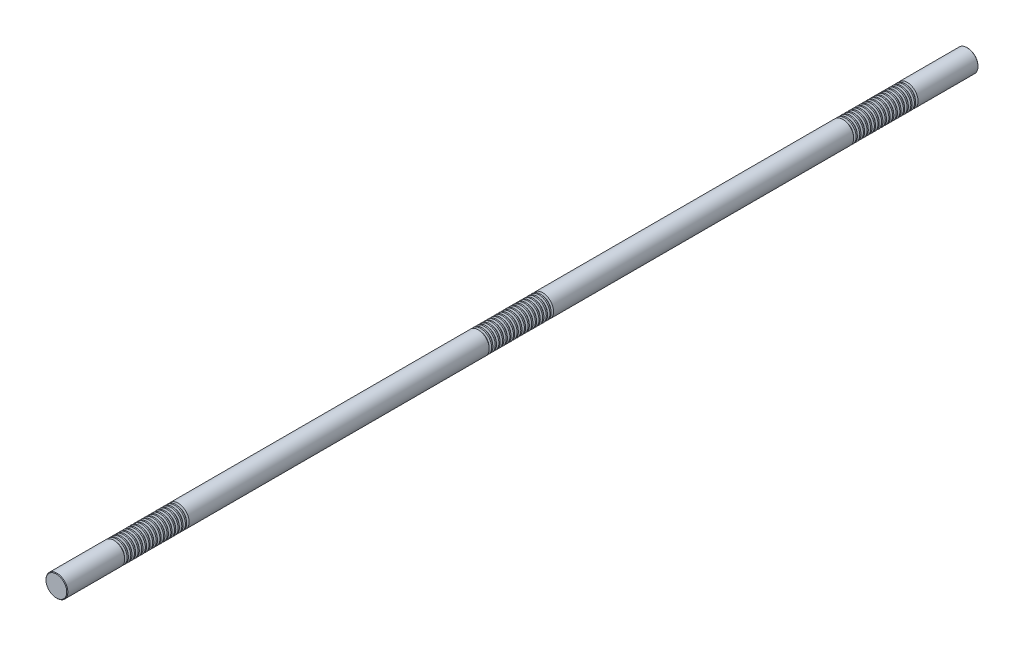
from build123d import *

# Parameters (mm, degrees)
SKETCH1_R           = 18
BOSS_EXTRUDE1_DEPTH = 750
CHAMFER1_SIZE       = 0.9
LPATTERN1_COUNT     = 18
LPATTERN1_PITCH     = 6
LPATTERN2_COUNT     = 3
LPATTERN2_PITCH     = 600


with BuildPart() as part:
    # Sketch1 → Boss-Extrude1 (new, symmetric)
    with BuildSketch(Plane.XY):
        Circle(SKETCH1_R)
    extrude(amount=BOSS_EXTRUDE1_DEPTH, both=True)

    # Chamfer1
    chamfer1_edges = [part.edges().sort_by_distance(p)[0] for p in [
        (-18, 0, -750),
        (-18, 0, 750),
    ]]
    chamfer(chamfer1_edges, length=CHAMFER1_SIZE)

    # Sketch2 → Cut-Revolve1 (revolve, cut)
    with BuildSketch(Plane(origin=(0, 0, 0), x_dir=(0, 0, -1), z_dir=(1, 0, 0)), mode=Mode.PRIVATE) as cut_revolve1_sk:
        Polygon((650.468911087, 18), (646.531088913, 18), (647.468911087, 14.5), (649.531088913, 14.5), align=None)
    cut_revolve1 = revolve(cut_revolve1_sk.sketch.rotate(Axis((0, 0, 750), (0, 0, -1)), 90), axis=Axis((0, 0, 750), (0, 0, -1)), mode=Mode.SUBTRACT)

    # LPattern1: Cut-Revolve1 ×18
    with Locations(*[(0, 0, i * LPATTERN1_PITCH) for i in range(1, LPATTERN1_COUNT)]):
        add(cut_revolve1, mode=Mode.SUBTRACT)

    # LPattern2: Cut-Revolve1 ×3
    with Locations(*[(0, 0, i * LPATTERN2_PITCH) for i in range(1, LPATTERN2_COUNT)]):
        add(cut_revolve1, mode=Mode.SUBTRACT)

    # LPattern2 copy 1 sketch → LPattern2 copy 1 (revolve, cut)
    with BuildSketch(Plane(origin=(0, 0, 606), x_dir=(0, 0, -1), z_dir=(1, 0, 0))):
        Polygon((650.468911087, 18), (646.531088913, 18), (647.468911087, 14.5), (649.531088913, 14.5), align=None)
    revolve(axis=Axis((0, 0, 1356), (0, 0, -1)), mode=Mode.SUBTRACT)

    # LPattern2 copy 2 sketch → LPattern2 copy 2 (revolve, cut)
    with BuildSketch(Plane(origin=(0, 0, 1206), x_dir=(0, 0, -1), z_dir=(1, 0, 0))):
        Polygon((650.468911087, 18), (646.531088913, 18), (647.468911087, 14.5), (649.531088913, 14.5), align=None)
    revolve(axis=Axis((0, 0, 1956), (0, 0, -1)), mode=Mode.SUBTRACT)

    # LPattern2 copy 3 sketch → LPattern2 copy 3 (revolve, cut)
    with BuildSketch(Plane(origin=(0, 0, 612), x_dir=(0, 0, -1), z_dir=(1, 0, 0))):
        Polygon((650.468911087, 18), (646.531088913, 18), (647.468911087, 14.5), (649.531088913, 14.5), align=None)
    revolve(axis=Axis((0, 0, 1362), (0, 0, -1)), mode=Mode.SUBTRACT)

    # LPattern2 copy 4 sketch → LPattern2 copy 4 (revolve, cut)
    with BuildSketch(Plane(origin=(0, 0, 1212), x_dir=(0, 0, -1), z_dir=(1, 0, 0))):
        Polygon((650.468911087, 18), (646.531088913, 18), (647.468911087, 14.5), (649.531088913, 14.5), align=None)
    revolve(axis=Axis((0, 0, 1962), (0, 0, -1)), mode=Mode.SUBTRACT)

    # LPattern2 copy 5 sketch → LPattern2 copy 5 (revolve, cut)
    with BuildSketch(Plane(origin=(0, 0, 618), x_dir=(0, 0, -1), z_dir=(1, 0, 0))):
        Polygon((650.468911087, 18), (646.531088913, 18), (647.468911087, 14.5), (649.531088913, 14.5), align=None)
    revolve(axis=Axis((0, 0, 1368), (0, 0, -1)), mode=Mode.SUBTRACT)

    # LPattern2 copy 6 sketch → LPattern2 copy 6 (revolve, cut)
    with BuildSketch(Plane(origin=(0, 0, 1218), x_dir=(0, 0, -1), z_dir=(1, 0, 0))):
        Polygon((650.468911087, 18), (646.531088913, 18), (647.468911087, 14.5), (649.531088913, 14.5), align=None)
    revolve(axis=Axis((0, 0, 1968), (0, 0, -1)), mode=Mode.SUBTRACT)

    # LPattern2 copy 7 sketch → LPattern2 copy 7 (revolve, cut)
    with BuildSketch(Plane(origin=(0, 0, 624), x_dir=(0, 0, -1), z_dir=(1, 0, 0))):
        Polygon((650.468911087, 18), (646.531088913, 18), (647.468911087, 14.5), (649.531088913, 14.5), align=None)
    revolve(axis=Axis((0, 0, 1374), (0, 0, -1)), mode=Mode.SUBTRACT)

    # LPattern2 copy 8 sketch → LPattern2 copy 8 (revolve, cut)
    with BuildSketch(Plane(origin=(0, 0, 1224), x_dir=(0, 0, -1), z_dir=(1, 0, 0))):
        Polygon((650.468911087, 18), (646.531088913, 18), (647.468911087, 14.5), (649.531088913, 14.5), align=None)
    revolve(axis=Axis((0, 0, 1974), (0, 0, -1)), mode=Mode.SUBTRACT)

    # LPattern2 copy 9 sketch → LPattern2 copy 9 (revolve, cut)
    with BuildSketch(Plane(origin=(0, 0, 630), x_dir=(0, 0, -1), z_dir=(1, 0, 0))):
        Polygon((650.468911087, 18), (646.531088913, 18), (647.468911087, 14.5), (649.531088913, 14.5), align=None)
    revolve(axis=Axis((0, 0, 1380), (0, 0, -1)), mode=Mode.SUBTRACT)

    # LPattern2 copy 10 sketch → LPattern2 copy 10 (revolve, cut)
    with BuildSketch(Plane(origin=(0, 0, 1230), x_dir=(0, 0, -1), z_dir=(1, 0, 0))):
        Polygon((650.468911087, 18), (646.531088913, 18), (647.468911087, 14.5), (649.531088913, 14.5), align=None)
    revolve(axis=Axis((0, 0, 1980), (0, 0, -1)), mode=Mode.SUBTRACT)

    # LPattern2 copy 11 sketch → LPattern2 copy 11 (revolve, cut)
    with BuildSketch(Plane(origin=(0, 0, 636), x_dir=(0, 0, -1), z_dir=(1, 0, 0))):
        Polygon((650.468911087, 18), (646.531088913, 18), (647.468911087, 14.5), (649.531088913, 14.5), align=None)
    revolve(axis=Axis((0, 0, 1386), (0, 0, -1)), mode=Mode.SUBTRACT)

    # LPattern2 copy 12 sketch → LPattern2 copy 12 (revolve, cut)
    with BuildSketch(Plane(origin=(0, 0, 1236), x_dir=(0, 0, -1), z_dir=(1, 0, 0))):
        Polygon((650.468911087, 18), (646.531088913, 18), (647.468911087, 14.5), (649.531088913, 14.5), align=None)
    revolve(axis=Axis((0, 0, 1986), (0, 0, -1)), mode=Mode.SUBTRACT)

    # LPattern2 copy 13 sketch → LPattern2 copy 13 (revolve, cut)
    with BuildSketch(Plane(origin=(0, 0, 642), x_dir=(0, 0, -1), z_dir=(1, 0, 0))):
        Polygon((650.468911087, 18), (646.531088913, 18), (647.468911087, 14.5), (649.531088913, 14.5), align=None)
    revolve(axis=Axis((0, 0, 1392), (0, 0, -1)), mode=Mode.SUBTRACT)

    # LPattern2 copy 14 sketch → LPattern2 copy 14 (revolve, cut)
    with BuildSketch(Plane(origin=(0, 0, 1242), x_dir=(0, 0, -1), z_dir=(1, 0, 0))):
        Polygon((650.468911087, 18), (646.531088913, 18), (647.468911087, 14.5), (649.531088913, 14.5), align=None)
    revolve(axis=Axis((0, 0, 1992), (0, 0, -1)), mode=Mode.SUBTRACT)

    # LPattern2 copy 15 sketch → LPattern2 copy 15 (revolve, cut)
    with BuildSketch(Plane(origin=(0, 0, 648), x_dir=(0, 0, -1), z_dir=(1, 0, 0))):
        Polygon((650.468911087, 18), (646.531088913, 18), (647.468911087, 14.5), (649.531088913, 14.5), align=None)
    revolve(axis=Axis((0, 0, 1398), (0, 0, -1)), mode=Mode.SUBTRACT)

    # LPattern2 copy 16 sketch → LPattern2 copy 16 (revolve, cut)
    with BuildSketch(Plane(origin=(0, 0, 1248), x_dir=(0, 0, -1), z_dir=(1, 0, 0))):
        Polygon((650.468911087, 18), (646.531088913, 18), (647.468911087, 14.5), (649.531088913, 14.5), align=None)
    revolve(axis=Axis((0, 0, 1998), (0, 0, -1)), mode=Mode.SUBTRACT)

    # LPattern2 copy 17 sketch → LPattern2 copy 17 (revolve, cut)
    with BuildSketch(Plane(origin=(0, 0, 654), x_dir=(0, 0, -1), z_dir=(1, 0, 0))):
        Polygon((650.468911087, 18), (646.531088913, 18), (647.468911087, 14.5), (649.531088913, 14.5), align=None)
    revolve(axis=Axis((0, 0, 1404), (0, 0, -1)), mode=Mode.SUBTRACT)

    # LPattern2 copy 18 sketch → LPattern2 copy 18 (revolve, cut)
    with BuildSketch(Plane(origin=(0, 0, 1254), x_dir=(0, 0, -1), z_dir=(1, 0, 0))):
        Polygon((650.468911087, 18), (646.531088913, 18), (647.468911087, 14.5), (649.531088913, 14.5), align=None)
    revolve(axis=Axis((0, 0, 2004), (0, 0, -1)), mode=Mode.SUBTRACT)

    # LPattern2 copy 19 sketch → LPattern2 copy 19 (revolve, cut)
    with BuildSketch(Plane(origin=(0, 0, 660), x_dir=(0, 0, -1), z_dir=(1, 0, 0))):
        Polygon((650.468911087, 18), (646.531088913, 18), (647.468911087, 14.5), (649.531088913, 14.5), align=None)
    revolve(axis=Axis((0, 0, 1410), (0, 0, -1)), mode=Mode.SUBTRACT)

    # LPattern2 copy 20 sketch → LPattern2 copy 20 (revolve, cut)
    with BuildSketch(Plane(origin=(0, 0, 1260), x_dir=(0, 0, -1), z_dir=(1, 0, 0))):
        Polygon((650.468911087, 18), (646.531088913, 18), (647.468911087, 14.5), (649.531088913, 14.5), align=None)
    revolve(axis=Axis((0, 0, 2010), (0, 0, -1)), mode=Mode.SUBTRACT)

    # LPattern2 copy 21 sketch → LPattern2 copy 21 (revolve, cut)
    with BuildSketch(Plane(origin=(0, 0, 666), x_dir=(0, 0, -1), z_dir=(1, 0, 0))):
        Polygon((650.468911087, 18), (646.531088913, 18), (647.468911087, 14.5), (649.531088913, 14.5), align=None)
    revolve(axis=Axis((0, 0, 1416), (0, 0, -1)), mode=Mode.SUBTRACT)

    # LPattern2 copy 22 sketch → LPattern2 copy 22 (revolve, cut)
    with BuildSketch(Plane(origin=(0, 0, 1266), x_dir=(0, 0, -1), z_dir=(1, 0, 0))):
        Polygon((650.468911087, 18), (646.531088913, 18), (647.468911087, 14.5), (649.531088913, 14.5), align=None)
    revolve(axis=Axis((0, 0, 2016), (0, 0, -1)), mode=Mode.SUBTRACT)

    # LPattern2 copy 23 sketch → LPattern2 copy 23 (revolve, cut)
    with BuildSketch(Plane(origin=(0, 0, 672), x_dir=(0, 0, -1), z_dir=(1, 0, 0))):
        Polygon((650.468911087, 18), (646.531088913, 18), (647.468911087, 14.5), (649.531088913, 14.5), align=None)
    revolve(axis=Axis((0, 0, 1422), (0, 0, -1)), mode=Mode.SUBTRACT)

    # LPattern2 copy 24 sketch → LPattern2 copy 24 (revolve, cut)
    with BuildSketch(Plane(origin=(0, 0, 1272), x_dir=(0, 0, -1), z_dir=(1, 0, 0))):
        Polygon((650.468911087, 18), (646.531088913, 18), (647.468911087, 14.5), (649.531088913, 14.5), align=None)
    revolve(axis=Axis((0, 0, 2022), (0, 0, -1)), mode=Mode.SUBTRACT)

    # LPattern2 copy 25 sketch → LPattern2 copy 25 (revolve, cut)
    with BuildSketch(Plane(origin=(0, 0, 678), x_dir=(0, 0, -1), z_dir=(1, 0, 0))):
        Polygon((650.468911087, 18), (646.531088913, 18), (647.468911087, 14.5), (649.531088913, 14.5), align=None)
    revolve(axis=Axis((0, 0, 1428), (0, 0, -1)), mode=Mode.SUBTRACT)

    # LPattern2 copy 26 sketch → LPattern2 copy 26 (revolve, cut)
    with BuildSketch(Plane(origin=(0, 0, 1278), x_dir=(0, 0, -1), z_dir=(1, 0, 0))):
        Polygon((650.468911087, 18), (646.531088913, 18), (647.468911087, 14.5), (649.531088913, 14.5), align=None)
    revolve(axis=Axis((0, 0, 2028), (0, 0, -1)), mode=Mode.SUBTRACT)

    # LPattern2 copy 27 sketch → LPattern2 copy 27 (revolve, cut)
    with BuildSketch(Plane(origin=(0, 0, 684), x_dir=(0, 0, -1), z_dir=(1, 0, 0))):
        Polygon((650.468911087, 18), (646.531088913, 18), (647.468911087, 14.5), (649.531088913, 14.5), align=None)
    revolve(axis=Axis((0, 0, 1434), (0, 0, -1)), mode=Mode.SUBTRACT)

    # LPattern2 copy 28 sketch → LPattern2 copy 28 (revolve, cut)
    with BuildSketch(Plane(origin=(0, 0, 1284), x_dir=(0, 0, -1), z_dir=(1, 0, 0))):
        Polygon((650.468911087, 18), (646.531088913, 18), (647.468911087, 14.5), (649.531088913, 14.5), align=None)
    revolve(axis=Axis((0, 0, 2034), (0, 0, -1)), mode=Mode.SUBTRACT)

    # LPattern2 copy 29 sketch → LPattern2 copy 29 (revolve, cut)
    with BuildSketch(Plane(origin=(0, 0, 690), x_dir=(0, 0, -1), z_dir=(1, 0, 0))):
        Polygon((650.468911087, 18), (646.531088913, 18), (647.468911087, 14.5), (649.531088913, 14.5), align=None)
    revolve(axis=Axis((0, 0, 1440), (0, 0, -1)), mode=Mode.SUBTRACT)

    # LPattern2 copy 30 sketch → LPattern2 copy 30 (revolve, cut)
    with BuildSketch(Plane(origin=(0, 0, 1290), x_dir=(0, 0, -1), z_dir=(1, 0, 0))):
        Polygon((650.468911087, 18), (646.531088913, 18), (647.468911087, 14.5), (649.531088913, 14.5), align=None)
    revolve(axis=Axis((0, 0, 2040), (0, 0, -1)), mode=Mode.SUBTRACT)

    # LPattern2 copy 31 sketch → LPattern2 copy 31 (revolve, cut)
    with BuildSketch(Plane(origin=(0, 0, 696), x_dir=(0, 0, -1), z_dir=(1, 0, 0))):
        Polygon((650.468911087, 18), (646.531088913, 18), (647.468911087, 14.5), (649.531088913, 14.5), align=None)
    revolve(axis=Axis((0, 0, 1446), (0, 0, -1)), mode=Mode.SUBTRACT)

    # LPattern2 copy 32 sketch → LPattern2 copy 32 (revolve, cut)
    with BuildSketch(Plane(origin=(0, 0, 1296), x_dir=(0, 0, -1), z_dir=(1, 0, 0))):
        Polygon((650.468911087, 18), (646.531088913, 18), (647.468911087, 14.5), (649.531088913, 14.5), align=None)
    revolve(axis=Axis((0, 0, 2046), (0, 0, -1)), mode=Mode.SUBTRACT)

    # LPattern2 copy 33 sketch → LPattern2 copy 33 (revolve, cut)
    with BuildSketch(Plane(origin=(0, 0, 702), x_dir=(0, 0, -1), z_dir=(1, 0, 0))):
        Polygon((650.468911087, 18), (646.531088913, 18), (647.468911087, 14.5), (649.531088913, 14.5), align=None)
    revolve(axis=Axis((0, 0, 1452), (0, 0, -1)), mode=Mode.SUBTRACT)

    # LPattern2 copy 34 sketch → LPattern2 copy 34 (revolve, cut)
    with BuildSketch(Plane(origin=(0, 0, 1302), x_dir=(0, 0, -1), z_dir=(1, 0, 0))):
        Polygon((650.468911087, 18), (646.531088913, 18), (647.468911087, 14.5), (649.531088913, 14.5), align=None)
    revolve(axis=Axis((0, 0, 2052), (0, 0, -1)), mode=Mode.SUBTRACT)


solid = part.part
